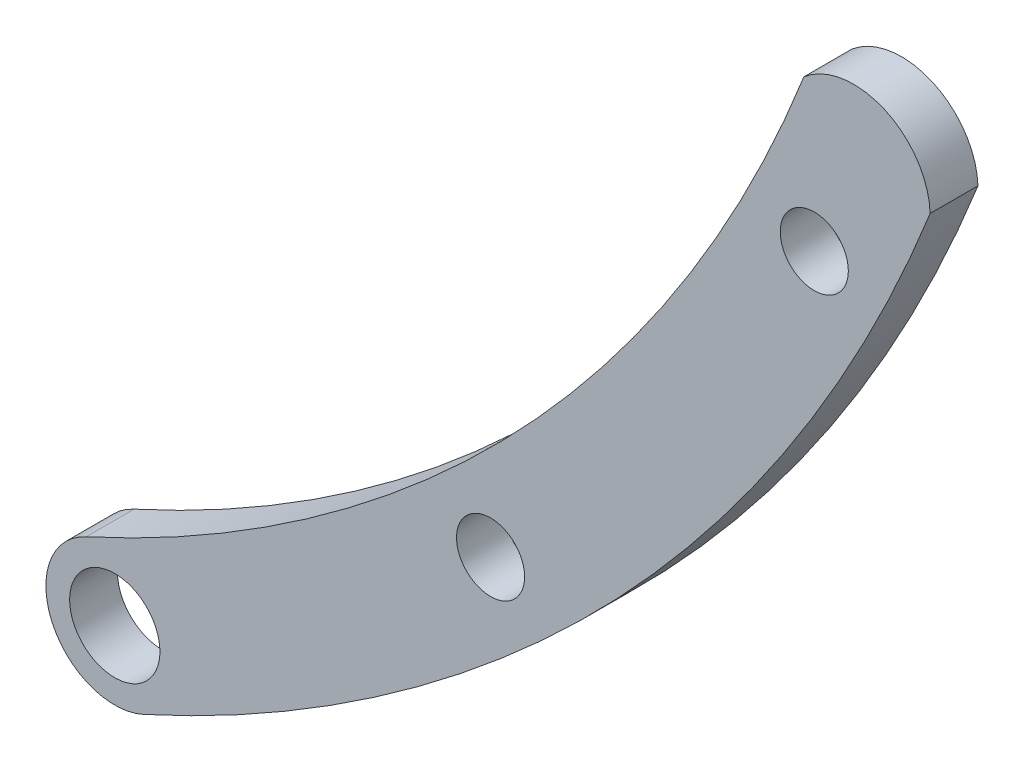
ISO-10303-21;
HEADER;
FILE_DESCRIPTION(('STEP AP214'),'2;1');
FILE_NAME('part.step','',(''),(''),'','','');
FILE_SCHEMA(('AUTOMOTIVE_DESIGN { 1 0 10303 214 1 1 1 1 }'));
ENDSEC;
DATA;
#1=APPLICATION_CONTEXT('core data for automotive mechanical design processes');
#2=APPLICATION_PROTOCOL_DEFINITION('international standard','automotive_design',2000,#1);
#3=PRODUCT_CONTEXT('',#1,'mechanical');
#4=PRODUCT('Part','Part','',(#3));
#5=PRODUCT_RELATED_PRODUCT_CATEGORY('part','',(#4));
#6=PRODUCT_DEFINITION_FORMATION('','',#4);
#7=PRODUCT_DEFINITION_CONTEXT('part definition',#1,'design');
#8=PRODUCT_DEFINITION('design','',#6,#7);
#9=PRODUCT_DEFINITION_SHAPE('','',#8);
#10=(LENGTH_UNIT() NAMED_UNIT(*) SI_UNIT(.MILLI.,.METRE.));
#11=(NAMED_UNIT(*) PLANE_ANGLE_UNIT() SI_UNIT($,.RADIAN.));
#12=(NAMED_UNIT(*) SI_UNIT($,.STERADIAN.) SOLID_ANGLE_UNIT());
#13=UNCERTAINTY_MEASURE_WITH_UNIT(LENGTH_MEASURE(1.E-05),#10,'distance_accuracy_value','');
#14=(GEOMETRIC_REPRESENTATION_CONTEXT(3) GLOBAL_UNCERTAINTY_ASSIGNED_CONTEXT((#13)) GLOBAL_UNIT_ASSIGNED_CONTEXT((#10,
#11,#12)) REPRESENTATION_CONTEXT('',''));
#15=CARTESIAN_POINT('',(0.,0.,0.));
#16=DIRECTION('',(0.,0.,1.));
#17=DIRECTION('',(1.,0.,0.));
#18=AXIS2_PLACEMENT_3D('',#15,#16,#17);
#19=CARTESIAN_POINT('',(-23.9673933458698,3.05846681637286,1.58750000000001));
#20=DIRECTION('',(0.,0.,-0.999999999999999));
#21=DIRECTION('',(-0.999999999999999,0.,0.));
#22=AXIS2_PLACEMENT_3D('',#19,#20,#21);
#23=PLANE('',#22);
#24=CARTESIAN_POINT('',(-1.4943540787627,-10.7338263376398,1.58750000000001));
#25=DIRECTION('',(0.,0.,0.999999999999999));
#26=DIRECTION('',(0.999999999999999,0.,0.));
#27=AXIS2_PLACEMENT_3D('',#24,#25,#26);
#28=CIRCLE('',#27,1.1303);
#29=CARTESIAN_POINT('',(-0.364054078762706,-10.7338263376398,1.58750000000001));
#30=VERTEX_POINT('',#29);
#31=EDGE_CURVE('E107',#30,#30,#28,.T.);
#32=ORIENTED_EDGE('',*,*,#31,.F.);
#33=EDGE_LOOP('',(#32));
#34=FACE_BOUND('',#33,.T.);
#35=CARTESIAN_POINT('',(9.25172308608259,3.43327413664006,1.5875));
#36=DIRECTION('',(0.,0.,0.999999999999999));
#37=DIRECTION('',(0.999999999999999,0.,0.));
#38=AXIS2_PLACEMENT_3D('',#35,#36,#37);
#39=CIRCLE('',#38,1.1303);
#40=CARTESIAN_POINT('',(10.3820230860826,3.43327413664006,1.5875));
#41=VERTEX_POINT('',#40);
#42=EDGE_CURVE('E98',#41,#41,#39,.T.);
#43=ORIENTED_EDGE('',*,*,#42,.F.);
#44=EDGE_LOOP('',(#43));
#45=FACE_BOUND('',#44,.T.);
#46=CARTESIAN_POINT('',(-33.9647866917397,25.0548821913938,1.5875));
#47=DIRECTION('',(0.,0.,0.999999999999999));
#48=DIRECTION('',(-0.999999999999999,0.,0.));
#49=AXIS2_PLACEMENT_3D('',#46,#47,#48);
#50=CIRCLE('',#49,50.6095);
#51=CARTESIAN_POINT('',(-13.0241230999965,-21.0190811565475,1.5875));
#52=VERTEX_POINT('',#51);
#53=CARTESIAN_POINT('',(13.0991355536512,6.44551054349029,1.58750000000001));
#54=VERTEX_POINT('',#53);
#55=EDGE_CURVE('E84',#52,#54,#50,.T.);
#56=ORIENTED_EDGE('',*,*,#55,.T.);
#57=CARTESIAN_POINT('',(10.5609319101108,6.34999999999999,1.58749999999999));
#58=DIRECTION('',(0.,0.,0.999999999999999));
#59=DIRECTION('',(0.999999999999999,0.,0.));
#60=AXIS2_PLACEMENT_3D('',#57,#58,#59);
#61=CIRCLE('',#60,2.54);
#62=CARTESIAN_POINT('',(8.90679250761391,8.27754321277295,1.5875));
#63=VERTEX_POINT('',#62);
#64=EDGE_CURVE('E49',#54,#63,#61,.T.);
#65=ORIENTED_EDGE('',*,*,#64,.T.);
#66=CARTESIAN_POINT('',(-33.9647866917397,25.0548821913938,1.5875));
#67=DIRECTION('',(0.,0.,-0.999999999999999));
#68=DIRECTION('',(-0.999999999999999,0.,0.));
#69=AXIS2_PLACEMENT_3D('',#66,#67,#68);
#70=CIRCLE('',#69,46.0375);
#71=CARTESIAN_POINT('',(-14.9158769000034,-16.8568159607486,1.5875));
#72=VERTEX_POINT('',#71);
#73=EDGE_CURVE('E91',#63,#72,#70,.T.);
#74=ORIENTED_EDGE('',*,*,#73,.T.);
#75=CARTESIAN_POINT('',(-13.97,-18.937948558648,1.5875));
#76=DIRECTION('',(0.,0.,0.999999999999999));
#77=DIRECTION('',(0.999999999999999,0.,0.));
#78=AXIS2_PLACEMENT_3D('',#75,#76,#77);
#79=CIRCLE('',#78,2.286);
#80=EDGE_CURVE('E58',#72,#52,#79,.T.);
#81=ORIENTED_EDGE('',*,*,#80,.T.);
#82=EDGE_LOOP('',(#56,#65,#74,#81));
#83=FACE_BOUND('',#82,.T.);
#84=CARTESIAN_POINT('',(-13.97,-18.937948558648,1.5875));
#85=DIRECTION('',(0.,0.,0.999999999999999));
#86=DIRECTION('',(0.999999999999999,0.,0.));
#87=AXIS2_PLACEMENT_3D('',#84,#85,#86);
#88=CIRCLE('',#87,1.4986);
#89=CARTESIAN_POINT('',(-15.4686,-18.937948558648,1.5875));
#90=VERTEX_POINT('',#89);
#91=EDGE_CURVE('E116',#90,#90,#88,.T.);
#92=ORIENTED_EDGE('',*,*,#91,.F.);
#93=EDGE_LOOP('',(#92));
#94=FACE_BOUND('',#93,.T.);
#95=ADVANCED_FACE('F32',(#34,#45,#83,#94),#23,.F.);
#96=CARTESIAN_POINT('',(-23.9673933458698,3.05846681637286,0.));
#97=DIRECTION('',(0.,0.,-0.999999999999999));
#98=DIRECTION('',(-0.999999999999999,0.,0.));
#99=AXIS2_PLACEMENT_3D('',#96,#97,#98);
#100=PLANE('',#99);
#101=CARTESIAN_POINT('',(-1.49435407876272,-10.7338263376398,0.));
#102=DIRECTION('',(0.,0.,-0.999999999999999));
#103=DIRECTION('',(-0.999999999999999,0.,0.));
#104=AXIS2_PLACEMENT_3D('',#101,#102,#103);
#105=CIRCLE('',#104,1.1303);
#106=CARTESIAN_POINT('',(-0.364054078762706,-10.7338263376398,0.));
#107=VERTEX_POINT('',#106);
#108=EDGE_CURVE('E36',#107,#107,#105,.T.);
#109=ORIENTED_EDGE('',*,*,#108,.F.);
#110=EDGE_LOOP('',(#109));
#111=FACE_BOUND('',#110,.T.);
#112=CARTESIAN_POINT('',(9.25172308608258,3.43327413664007,0.));
#113=DIRECTION('',(0.,0.,-0.999999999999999));
#114=DIRECTION('',(-0.999999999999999,0.,0.));
#115=AXIS2_PLACEMENT_3D('',#112,#113,#114);
#116=CIRCLE('',#115,1.1303);
#117=CARTESIAN_POINT('',(10.3820230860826,3.43327413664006,0.));
#118=VERTEX_POINT('',#117);
#119=EDGE_CURVE('E95',#118,#118,#116,.T.);
#120=ORIENTED_EDGE('',*,*,#119,.F.);
#121=EDGE_LOOP('',(#120));
#122=FACE_BOUND('',#121,.T.);
#123=CARTESIAN_POINT('',(10.5609319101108,6.34999999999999,0.));
#124=DIRECTION('',(0.,0.,-0.999999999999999));
#125=DIRECTION('',(-0.999999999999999,0.,0.));
#126=AXIS2_PLACEMENT_3D('',#123,#124,#125);
#127=CIRCLE('',#126,2.54);
#128=CARTESIAN_POINT('',(13.0991355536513,6.44551054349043,0.));
#129=VERTEX_POINT('',#128);
#130=CARTESIAN_POINT('',(8.90679250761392,8.27754321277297,0.));
#131=VERTEX_POINT('',#130);
#132=EDGE_CURVE('E90',#129,#131,#127,.F.);
#133=ORIENTED_EDGE('',*,*,#132,.F.);
#134=CARTESIAN_POINT('',(-33.9647866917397,25.0548821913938,0.));
#135=DIRECTION('',(0.,0.,0.999999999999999));
#136=DIRECTION('',(-0.999999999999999,0.,0.));
#137=AXIS2_PLACEMENT_3D('',#134,#135,#136);
#138=CIRCLE('',#137,50.6095);
#139=CARTESIAN_POINT('',(-13.0241230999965,-21.0190811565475,0.));
#140=VERTEX_POINT('',#139);
#141=EDGE_CURVE('E78',#140,#129,#138,.T.);
#142=ORIENTED_EDGE('',*,*,#141,.F.);
#143=CARTESIAN_POINT('',(-13.97,-18.937948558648,0.));
#144=DIRECTION('',(0.,0.,0.999999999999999));
#145=DIRECTION('',(0.999999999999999,0.,0.));
#146=AXIS2_PLACEMENT_3D('',#143,#144,#145);
#147=CIRCLE('',#146,2.286);
#148=CARTESIAN_POINT('',(-14.9158769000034,-16.8568159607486,0.));
#149=VERTEX_POINT('',#148);
#150=EDGE_CURVE('E70',#149,#140,#147,.T.);
#151=ORIENTED_EDGE('',*,*,#150,.F.);
#152=CARTESIAN_POINT('',(-33.9647866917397,25.0548821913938,0.));
#153=DIRECTION('',(0.,0.,-0.999999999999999));
#154=DIRECTION('',(-0.999999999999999,0.,0.));
#155=AXIS2_PLACEMENT_3D('',#152,#153,#154);
#156=CIRCLE('',#155,46.0375);
#157=EDGE_CURVE('E79',#131,#149,#156,.T.);
#158=ORIENTED_EDGE('',*,*,#157,.F.);
#159=EDGE_LOOP('',(#133,#142,#151,#158));
#160=FACE_BOUND('',#159,.T.);
#161=CARTESIAN_POINT('',(-13.97,-18.937948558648,0.));
#162=DIRECTION('',(0.,0.,0.999999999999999));
#163=DIRECTION('',(0.999999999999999,0.,0.));
#164=AXIS2_PLACEMENT_3D('',#161,#162,#163);
#165=CIRCLE('',#164,1.4986);
#166=CARTESIAN_POINT('',(-15.4686,-18.937948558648,0.));
#167=VERTEX_POINT('',#166);
#168=EDGE_CURVE('E115',#167,#167,#165,.T.);
#169=ORIENTED_EDGE('',*,*,#168,.T.);
#170=EDGE_LOOP('',(#169));
#171=FACE_BOUND('',#170,.T.);
#172=ADVANCED_FACE('F87',(#111,#122,#160,#171),#100,.T.);
#173=CARTESIAN_POINT('',(-33.9647866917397,25.0548821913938,1.5875));
#174=DIRECTION('',(0.,0.,-0.999999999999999));
#175=DIRECTION('',(-0.999999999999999,0.,0.));
#176=AXIS2_PLACEMENT_3D('',#173,#174,#175);
#177=CYLINDRICAL_SURFACE('',#176,46.0375);
#178=ORIENTED_EDGE('',*,*,#73,.F.);
#179=DIRECTION('',(0.,0.,-0.999999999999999));
#180=VECTOR('',#179,1.);
#181=CARTESIAN_POINT('',(8.90679250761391,8.27754321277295,1.5875));
#182=LINE('',#181,#180);
#183=EDGE_CURVE('E111',#63,#131,#182,.T.);
#184=ORIENTED_EDGE('',*,*,#183,.T.);
#185=ORIENTED_EDGE('',*,*,#157,.T.);
#186=DIRECTION('',(0.,0.,-0.999999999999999));
#187=VECTOR('',#186,1.);
#188=CARTESIAN_POINT('',(-14.9158769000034,-16.8568159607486,1.5875));
#189=LINE('',#188,#187);
#190=EDGE_CURVE('E11',#72,#149,#189,.T.);
#191=ORIENTED_EDGE('',*,*,#190,.F.);
#192=EDGE_LOOP('',(#178,#184,#185,#191));
#193=FACE_BOUND('',#192,.T.);
#194=ADVANCED_FACE('F34',(#193),#177,.F.);
#195=CARTESIAN_POINT('',(-13.97,-18.937948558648,1.5875));
#196=DIRECTION('',(0.,0.,-0.999999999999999));
#197=DIRECTION('',(-0.999999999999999,0.,0.));
#198=AXIS2_PLACEMENT_3D('',#195,#196,#197);
#199=CYLINDRICAL_SURFACE('',#198,2.286);
#200=ORIENTED_EDGE('',*,*,#150,.T.);
#201=DIRECTION('',(0.,0.,-0.999999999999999));
#202=VECTOR('',#201,1.);
#203=CARTESIAN_POINT('',(-13.0241230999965,-21.0190811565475,1.5875));
#204=LINE('',#203,#202);
#205=EDGE_CURVE('E41',#52,#140,#204,.T.);
#206=ORIENTED_EDGE('',*,*,#205,.F.);
#207=ORIENTED_EDGE('',*,*,#80,.F.);
#208=ORIENTED_EDGE('',*,*,#190,.T.);
#209=EDGE_LOOP('',(#200,#206,#207,#208));
#210=FACE_BOUND('',#209,.T.);
#211=ADVANCED_FACE('F72',(#210),#199,.T.);
#212=CARTESIAN_POINT('',(-33.9647866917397,25.0548821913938,1.5875));
#213=DIRECTION('',(0.,0.,-0.999999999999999));
#214=DIRECTION('',(-0.999999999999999,0.,0.));
#215=AXIS2_PLACEMENT_3D('',#212,#213,#214);
#216=CYLINDRICAL_SURFACE('',#215,50.6095);
#217=ORIENTED_EDGE('',*,*,#141,.T.);
#218=DIRECTION('',(0.,0.,-0.999999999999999));
#219=VECTOR('',#218,1.);
#220=CARTESIAN_POINT('',(13.0991355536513,6.44551054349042,1.58750000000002));
#221=LINE('',#220,#219);
#222=EDGE_CURVE('E97',#54,#129,#221,.T.);
#223=ORIENTED_EDGE('',*,*,#222,.F.);
#224=ORIENTED_EDGE('',*,*,#55,.F.);
#225=ORIENTED_EDGE('',*,*,#205,.T.);
#226=EDGE_LOOP('',(#217,#223,#224,#225));
#227=FACE_BOUND('',#226,.T.);
#228=ADVANCED_FACE('F83',(#227),#216,.T.);
#229=CARTESIAN_POINT('',(-13.97,-18.937948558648,1.5875));
#230=DIRECTION('',(0.,0.,-0.999999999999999));
#231=DIRECTION('',(-0.999999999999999,0.,0.));
#232=AXIS2_PLACEMENT_3D('',#229,#230,#231);
#233=CYLINDRICAL_SURFACE('',#232,1.4986);
#234=CARTESIAN_POINT('',(-15.4686,-18.937948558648,1.5875));
#235=CARTESIAN_POINT('',(-15.4686,-18.937948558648,1.57096354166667));
#236=CARTESIAN_POINT('',(-15.4686,-18.937948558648,1.55442708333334));
#237=CARTESIAN_POINT('',(-15.4686,-18.937948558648,1.52135416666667));
#238=CARTESIAN_POINT('',(-15.4686,-18.937948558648,1.50481770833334));
#239=CARTESIAN_POINT('',(-15.4686,-18.937948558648,1.47174479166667));
#240=CARTESIAN_POINT('',(-15.4686,-18.937948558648,1.45520833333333));
#241=CARTESIAN_POINT('',(-15.4686,-18.937948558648,1.42213541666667));
#242=CARTESIAN_POINT('',(-15.4686,-18.937948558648,1.40559895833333));
#243=CARTESIAN_POINT('',(-15.4686,-18.937948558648,1.37252604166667));
#244=CARTESIAN_POINT('',(-15.4686,-18.937948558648,1.35598958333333));
#245=CARTESIAN_POINT('',(-15.4686,-18.937948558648,1.32291666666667));
#246=CARTESIAN_POINT('',(-15.4686,-18.937948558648,1.30638020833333));
#247=CARTESIAN_POINT('',(-15.4686,-18.937948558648,1.27330729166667));
#248=CARTESIAN_POINT('',(-15.4686,-18.937948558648,1.25677083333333));
#249=CARTESIAN_POINT('',(-15.4686,-18.937948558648,1.22369791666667));
#250=CARTESIAN_POINT('',(-15.4686,-18.937948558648,1.20716145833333));
#251=CARTESIAN_POINT('',(-15.4686,-18.937948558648,1.17408854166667));
#252=CARTESIAN_POINT('',(-15.4686,-18.937948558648,1.15755208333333));
#253=CARTESIAN_POINT('',(-15.4686,-18.937948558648,1.12447916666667));
#254=CARTESIAN_POINT('',(-15.4686,-18.937948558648,1.10794270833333));
#255=CARTESIAN_POINT('',(-15.4686,-18.937948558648,1.07486979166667));
#256=CARTESIAN_POINT('',(-15.4686,-18.937948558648,1.05833333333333));
#257=CARTESIAN_POINT('',(-15.4686,-18.937948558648,1.02526041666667));
#258=CARTESIAN_POINT('',(-15.4686,-18.937948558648,1.00872395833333));
#259=CARTESIAN_POINT('',(-15.4686,-18.937948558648,0.975651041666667));
#260=CARTESIAN_POINT('',(-15.4686,-18.937948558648,0.959114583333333));
#261=CARTESIAN_POINT('',(-15.4686,-18.937948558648,0.926041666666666));
#262=CARTESIAN_POINT('',(-15.4686,-18.937948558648,0.909505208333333));
#263=CARTESIAN_POINT('',(-15.4686,-18.937948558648,0.876432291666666));
#264=CARTESIAN_POINT('',(-15.4686,-18.937948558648,0.859895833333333));
#265=CARTESIAN_POINT('',(-15.4686,-18.937948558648,0.826822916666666));
#266=CARTESIAN_POINT('',(-15.4686,-18.937948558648,0.810286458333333));
#267=CARTESIAN_POINT('',(-15.4686,-18.937948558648,0.777213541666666));
#268=CARTESIAN_POINT('',(-15.4686,-18.937948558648,0.760677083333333));
#269=CARTESIAN_POINT('',(-15.4686,-18.937948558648,0.727604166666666));
#270=CARTESIAN_POINT('',(-15.4686,-18.937948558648,0.711067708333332));
#271=CARTESIAN_POINT('',(-15.4686,-18.937948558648,0.677994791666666));
#272=CARTESIAN_POINT('',(-15.4686,-18.937948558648,0.661458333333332));
#273=CARTESIAN_POINT('',(-15.4686,-18.937948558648,0.628385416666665));
#274=CARTESIAN_POINT('',(-15.4686,-18.937948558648,0.611848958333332));
#275=CARTESIAN_POINT('',(-15.4686,-18.937948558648,0.578776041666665));
#276=CARTESIAN_POINT('',(-15.4686,-18.937948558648,0.562239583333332));
#277=CARTESIAN_POINT('',(-15.4686,-18.937948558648,0.529166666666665));
#278=CARTESIAN_POINT('',(-15.4686,-18.937948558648,0.512630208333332));
#279=CARTESIAN_POINT('',(-15.4686,-18.937948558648,0.479557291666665));
#280=CARTESIAN_POINT('',(-15.4686,-18.937948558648,0.463020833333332));
#281=CARTESIAN_POINT('',(-15.4686,-18.937948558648,0.429947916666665));
#282=CARTESIAN_POINT('',(-15.4686,-18.937948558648,0.413411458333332));
#283=CARTESIAN_POINT('',(-15.4686,-18.937948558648,0.380338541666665));
#284=CARTESIAN_POINT('',(-15.4686,-18.937948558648,0.363802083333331));
#285=CARTESIAN_POINT('',(-15.4686,-18.937948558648,0.330729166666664));
#286=CARTESIAN_POINT('',(-15.4686,-18.937948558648,0.314192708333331));
#287=CARTESIAN_POINT('',(-15.4686,-18.937948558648,0.281119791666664));
#288=CARTESIAN_POINT('',(-15.4686,-18.937948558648,0.264583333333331));
#289=CARTESIAN_POINT('',(-15.4686,-18.937948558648,0.231510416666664));
#290=CARTESIAN_POINT('',(-15.4686,-18.937948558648,0.214973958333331));
#291=CARTESIAN_POINT('',(-15.4686,-18.937948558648,0.181901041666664));
#292=CARTESIAN_POINT('',(-15.4686,-18.937948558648,0.16536458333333));
#293=CARTESIAN_POINT('',(-15.4686,-18.937948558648,0.132291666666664));
#294=CARTESIAN_POINT('',(-15.4686,-18.937948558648,0.11575520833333));
#295=CARTESIAN_POINT('',(-15.4686,-18.937948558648,0.0826822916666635));
#296=CARTESIAN_POINT('',(-15.4686,-18.937948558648,0.0661458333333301));
#297=CARTESIAN_POINT('',(-15.4686,-18.937948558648,0.0330729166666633));
#298=CARTESIAN_POINT('',(-15.4686,-18.937948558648,0.0165364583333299));
#299=CARTESIAN_POINT('',(-15.4686,-18.937948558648,0.));
#300=B_SPLINE_CURVE_WITH_KNOTS('',3,(#234,#235,#236,#237,#238,#239,#240,#241,#242,#243,#244,
#245,#246,#247,#248,#249,#250,#251,#252,#253,#254,#255,#256,#257,#258,#259,#260,#261,#262,#263,
#264,#265,#266,#267,#268,#269,#270,#271,#272,#273,#274,#275,#276,#277,#278,#279,#280,#281,#282,
#283,#284,#285,#286,#287,#288,#289,#290,#291,#292,#293,#294,#295,#296,#297,#298,#299),
.UNSPECIFIED.,.F.,.F.,(4,2,2,2,2,2,2,2,2,2,2,2,2,2,2,2,2,2,2,2,2,2,2,2,2,2,2,2,2,2,2,2,4),(0.,
0.0496093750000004,0.0992187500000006,0.148828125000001,0.198437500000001,0.248046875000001,
0.297656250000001,0.347265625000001,0.396875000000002,0.446484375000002,0.496093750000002,
0.545703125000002,0.595312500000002,0.644921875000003,0.694531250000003,0.744140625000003,
0.793750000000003,0.843359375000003,0.892968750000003,0.942578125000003,0.992187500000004,
1.041796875,1.09140625,1.141015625,1.190625,1.240234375,1.28984375,1.33945312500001,
1.38906250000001,1.43867187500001,1.48828125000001,1.53789062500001,1.58750000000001),.UNSPECIFIED.);
#301=EDGE_CURVE('BSEAM135',#90,#167,#300,.T.);
#302=ORIENTED_EDGE('',*,*,#91,.T.);
#303=ORIENTED_EDGE('',*,*,#168,.F.);
#304=ORIENTED_EDGE('',*,*,#301,.T.);
#305=ORIENTED_EDGE('',*,*,#301,.F.);
#306=EDGE_LOOP('',(#302,#304,#303,#305));
#307=FACE_BOUND('',#306,.T.);
#308=ADVANCED_FACE('F135',(#307),#233,.F.);
#309=CARTESIAN_POINT('',(10.5609319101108,6.34999999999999,1.58749999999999));
#310=DIRECTION('',(0.,0.,-0.999999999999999));
#311=DIRECTION('',(-0.999999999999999,0.,0.));
#312=AXIS2_PLACEMENT_3D('',#309,#310,#311);
#313=CYLINDRICAL_SURFACE('',#312,2.54);
#314=ORIENTED_EDGE('',*,*,#222,.T.);
#315=ORIENTED_EDGE('',*,*,#132,.T.);
#316=ORIENTED_EDGE('',*,*,#183,.F.);
#317=ORIENTED_EDGE('',*,*,#64,.F.);
#318=EDGE_LOOP('',(#314,#315,#316,#317));
#319=FACE_BOUND('',#318,.T.);
#320=ADVANCED_FACE('F128',(#319),#313,.T.);
#321=CARTESIAN_POINT('',(9.25172308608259,3.43327413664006,1.5875));
#322=DIRECTION('',(0.,0.,0.999999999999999));
#323=DIRECTION('',(0.999999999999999,0.,0.));
#324=AXIS2_PLACEMENT_3D('',#321,#322,#323);
#325=CYLINDRICAL_SURFACE('',#324,1.1303);
#326=CARTESIAN_POINT('',(10.3820230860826,3.43327413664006,0.));
#327=CARTESIAN_POINT('',(10.3820230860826,3.43327413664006,0.0165364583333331));
#328=CARTESIAN_POINT('',(10.3820230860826,3.43327413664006,0.0330729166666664));
#329=CARTESIAN_POINT('',(10.3820230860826,3.43327413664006,0.0661458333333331));
#330=CARTESIAN_POINT('',(10.3820230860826,3.43327413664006,0.0826822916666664));
#331=CARTESIAN_POINT('',(10.3820230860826,3.43327413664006,0.115755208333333));
#332=CARTESIAN_POINT('',(10.3820230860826,3.43327413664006,0.132291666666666));
#333=CARTESIAN_POINT('',(10.3820230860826,3.43327413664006,0.165364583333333));
#334=CARTESIAN_POINT('',(10.3820230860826,3.43327413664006,0.181901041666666));
#335=CARTESIAN_POINT('',(10.3820230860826,3.43327413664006,0.214973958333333));
#336=CARTESIAN_POINT('',(10.3820230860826,3.43327413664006,0.231510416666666));
#337=CARTESIAN_POINT('',(10.3820230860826,3.43327413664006,0.264583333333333));
#338=CARTESIAN_POINT('',(10.3820230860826,3.43327413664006,0.281119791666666));
#339=CARTESIAN_POINT('',(10.3820230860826,3.43327413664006,0.314192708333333));
#340=CARTESIAN_POINT('',(10.3820230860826,3.43327413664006,0.330729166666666));
#341=CARTESIAN_POINT('',(10.3820230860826,3.43327413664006,0.363802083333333));
#342=CARTESIAN_POINT('',(10.3820230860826,3.43327413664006,0.380338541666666));
#343=CARTESIAN_POINT('',(10.3820230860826,3.43327413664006,0.413411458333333));
#344=CARTESIAN_POINT('',(10.3820230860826,3.43327413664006,0.429947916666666));
#345=CARTESIAN_POINT('',(10.3820230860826,3.43327413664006,0.463020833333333));
#346=CARTESIAN_POINT('',(10.3820230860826,3.43327413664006,0.479557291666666));
#347=CARTESIAN_POINT('',(10.3820230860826,3.43327413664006,0.512630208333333));
#348=CARTESIAN_POINT('',(10.3820230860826,3.43327413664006,0.529166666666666));
#349=CARTESIAN_POINT('',(10.3820230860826,3.43327413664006,0.562239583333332));
#350=CARTESIAN_POINT('',(10.3820230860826,3.43327413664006,0.578776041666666));
#351=CARTESIAN_POINT('',(10.3820230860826,3.43327413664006,0.611848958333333));
#352=CARTESIAN_POINT('',(10.3820230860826,3.43327413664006,0.628385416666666));
#353=CARTESIAN_POINT('',(10.3820230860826,3.43327413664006,0.661458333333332));
#354=CARTESIAN_POINT('',(10.3820230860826,3.43327413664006,0.677994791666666));
#355=CARTESIAN_POINT('',(10.3820230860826,3.43327413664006,0.711067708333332));
#356=CARTESIAN_POINT('',(10.3820230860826,3.43327413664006,0.727604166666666));
#357=CARTESIAN_POINT('',(10.3820230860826,3.43327413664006,0.760677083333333));
#358=CARTESIAN_POINT('',(10.3820230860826,3.43327413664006,0.777213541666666));
#359=CARTESIAN_POINT('',(10.3820230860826,3.43327413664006,0.810286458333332));
#360=CARTESIAN_POINT('',(10.3820230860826,3.43327413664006,0.826822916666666));
#361=CARTESIAN_POINT('',(10.3820230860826,3.43327413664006,0.859895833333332));
#362=CARTESIAN_POINT('',(10.3820230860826,3.43327413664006,0.876432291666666));
#363=CARTESIAN_POINT('',(10.3820230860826,3.43327413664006,0.909505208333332));
#364=CARTESIAN_POINT('',(10.3820230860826,3.43327413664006,0.926041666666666));
#365=CARTESIAN_POINT('',(10.3820230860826,3.43327413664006,0.959114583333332));
#366=CARTESIAN_POINT('',(10.3820230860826,3.43327413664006,0.975651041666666));
#367=CARTESIAN_POINT('',(10.3820230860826,3.43327413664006,1.00872395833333));
#368=CARTESIAN_POINT('',(10.3820230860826,3.43327413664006,1.02526041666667));
#369=CARTESIAN_POINT('',(10.3820230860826,3.43327413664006,1.05833333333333));
#370=CARTESIAN_POINT('',(10.3820230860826,3.43327413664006,1.07486979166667));
#371=CARTESIAN_POINT('',(10.3820230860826,3.43327413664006,1.10794270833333));
#372=CARTESIAN_POINT('',(10.3820230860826,3.43327413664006,1.12447916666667));
#373=CARTESIAN_POINT('',(10.3820230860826,3.43327413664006,1.15755208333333));
#374=CARTESIAN_POINT('',(10.3820230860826,3.43327413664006,1.17408854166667));
#375=CARTESIAN_POINT('',(10.3820230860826,3.43327413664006,1.20716145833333));
#376=CARTESIAN_POINT('',(10.3820230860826,3.43327413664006,1.22369791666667));
#377=CARTESIAN_POINT('',(10.3820230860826,3.43327413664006,1.25677083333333));
#378=CARTESIAN_POINT('',(10.3820230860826,3.43327413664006,1.27330729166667));
#379=CARTESIAN_POINT('',(10.3820230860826,3.43327413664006,1.30638020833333));
#380=CARTESIAN_POINT('',(10.3820230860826,3.43327413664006,1.32291666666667));
#381=CARTESIAN_POINT('',(10.3820230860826,3.43327413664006,1.35598958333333));
#382=CARTESIAN_POINT('',(10.3820230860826,3.43327413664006,1.37252604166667));
#383=CARTESIAN_POINT('',(10.3820230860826,3.43327413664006,1.40559895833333));
#384=CARTESIAN_POINT('',(10.3820230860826,3.43327413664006,1.42213541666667));
#385=CARTESIAN_POINT('',(10.3820230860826,3.43327413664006,1.45520833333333));
#386=CARTESIAN_POINT('',(10.3820230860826,3.43327413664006,1.47174479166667));
#387=CARTESIAN_POINT('',(10.3820230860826,3.43327413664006,1.50481770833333));
#388=CARTESIAN_POINT('',(10.3820230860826,3.43327413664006,1.52135416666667));
#389=CARTESIAN_POINT('',(10.3820230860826,3.43327413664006,1.55442708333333));
#390=CARTESIAN_POINT('',(10.3820230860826,3.43327413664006,1.57096354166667));
#391=CARTESIAN_POINT('',(10.3820230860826,3.43327413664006,1.5875));
#392=B_SPLINE_CURVE_WITH_KNOTS('',3,(#326,#327,#328,#329,#330,#331,#332,#333,#334,#335,#336,
#337,#338,#339,#340,#341,#342,#343,#344,#345,#346,#347,#348,#349,#350,#351,#352,#353,#354,#355,
#356,#357,#358,#359,#360,#361,#362,#363,#364,#365,#366,#367,#368,#369,#370,#371,#372,#373,#374,
#375,#376,#377,#378,#379,#380,#381,#382,#383,#384,#385,#386,#387,#388,#389,#390,#391),
.UNSPECIFIED.,.F.,.F.,(4,2,2,2,2,2,2,2,2,2,2,2,2,2,2,2,2,2,2,2,2,2,2,2,2,2,2,2,2,2,2,2,4),(0.,
0.049609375,0.0992187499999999,0.148828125,0.1984375,0.248046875,0.29765625,0.347265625,
0.396875,0.446484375,0.49609375,0.545703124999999,0.595312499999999,0.644921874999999,
0.694531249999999,0.744140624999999,0.793749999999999,0.843359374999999,0.892968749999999,
0.942578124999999,0.992187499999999,1.041796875,1.09140625,1.141015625,1.190625,1.240234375,
1.28984375,1.339453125,1.3890625,1.438671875,1.48828125,1.537890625,1.5875),.UNSPECIFIED.);
#393=EDGE_CURVE('BSEAM169',#118,#41,#392,.T.);
#394=ORIENTED_EDGE('',*,*,#119,.T.);
#395=ORIENTED_EDGE('',*,*,#42,.T.);
#396=ORIENTED_EDGE('',*,*,#393,.T.);
#397=ORIENTED_EDGE('',*,*,#393,.F.);
#398=EDGE_LOOP('',(#394,#396,#395,#397));
#399=FACE_BOUND('',#398,.T.);
#400=ADVANCED_FACE('F169',(#399),#325,.F.);
#401=CARTESIAN_POINT('',(-1.4943540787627,-10.7338263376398,1.58750000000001));
#402=DIRECTION('',(0.,0.,0.999999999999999));
#403=DIRECTION('',(0.999999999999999,0.,0.));
#404=AXIS2_PLACEMENT_3D('',#401,#402,#403);
#405=CYLINDRICAL_SURFACE('',#404,1.1303);
#406=CARTESIAN_POINT('',(-0.364054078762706,-10.7338263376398,0.));
#407=CARTESIAN_POINT('',(-0.364054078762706,-10.7338263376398,0.0165364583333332));
#408=CARTESIAN_POINT('',(-0.364054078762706,-10.7338263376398,0.0330729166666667));
#409=CARTESIAN_POINT('',(-0.364054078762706,-10.7338263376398,0.0661458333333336));
#410=CARTESIAN_POINT('',(-0.364054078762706,-10.7338263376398,0.082682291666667));
#411=CARTESIAN_POINT('',(-0.364054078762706,-10.7338263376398,0.115755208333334));
#412=CARTESIAN_POINT('',(-0.364054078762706,-10.7338263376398,0.132291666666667));
#413=CARTESIAN_POINT('',(-0.364054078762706,-10.7338263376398,0.165364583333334));
#414=CARTESIAN_POINT('',(-0.364054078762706,-10.7338263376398,0.181901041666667));
#415=CARTESIAN_POINT('',(-0.364054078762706,-10.7338263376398,0.214973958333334));
#416=CARTESIAN_POINT('',(-0.364054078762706,-10.7338263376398,0.231510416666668));
#417=CARTESIAN_POINT('',(-0.364054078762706,-10.7338263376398,0.264583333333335));
#418=CARTESIAN_POINT('',(-0.364054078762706,-10.7338263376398,0.281119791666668));
#419=CARTESIAN_POINT('',(-0.364054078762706,-10.7338263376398,0.314192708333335));
#420=CARTESIAN_POINT('',(-0.364054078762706,-10.7338263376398,0.330729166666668));
#421=CARTESIAN_POINT('',(-0.364054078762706,-10.7338263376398,0.363802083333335));
#422=CARTESIAN_POINT('',(-0.364054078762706,-10.7338263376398,0.380338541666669));
#423=CARTESIAN_POINT('',(-0.364054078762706,-10.7338263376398,0.413411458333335));
#424=CARTESIAN_POINT('',(-0.364054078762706,-10.7338263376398,0.429947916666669));
#425=CARTESIAN_POINT('',(-0.364054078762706,-10.7338263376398,0.463020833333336));
#426=CARTESIAN_POINT('',(-0.364054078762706,-10.7338263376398,0.479557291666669));
#427=CARTESIAN_POINT('',(-0.364054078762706,-10.7338263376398,0.512630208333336));
#428=CARTESIAN_POINT('',(-0.364054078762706,-10.7338263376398,0.529166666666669));
#429=CARTESIAN_POINT('',(-0.364054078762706,-10.7338263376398,0.562239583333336));
#430=CARTESIAN_POINT('',(-0.364054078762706,-10.7338263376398,0.57877604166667));
#431=CARTESIAN_POINT('',(-0.364054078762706,-10.7338263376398,0.611848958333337));
#432=CARTESIAN_POINT('',(-0.364054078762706,-10.7338263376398,0.62838541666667));
#433=CARTESIAN_POINT('',(-0.364054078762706,-10.7338263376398,0.661458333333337));
#434=CARTESIAN_POINT('',(-0.364054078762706,-10.7338263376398,0.67799479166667));
#435=CARTESIAN_POINT('',(-0.364054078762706,-10.7338263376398,0.711067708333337));
#436=CARTESIAN_POINT('',(-0.364054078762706,-10.7338263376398,0.727604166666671));
#437=CARTESIAN_POINT('',(-0.364054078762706,-10.7338263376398,0.760677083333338));
#438=CARTESIAN_POINT('',(-0.364054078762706,-10.7338263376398,0.777213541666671));
#439=CARTESIAN_POINT('',(-0.364054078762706,-10.7338263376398,0.810286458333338));
#440=CARTESIAN_POINT('',(-0.364054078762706,-10.7338263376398,0.826822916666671));
#441=CARTESIAN_POINT('',(-0.364054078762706,-10.7338263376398,0.859895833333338));
#442=CARTESIAN_POINT('',(-0.364054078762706,-10.7338263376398,0.876432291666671));
#443=CARTESIAN_POINT('',(-0.364054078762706,-10.7338263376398,0.909505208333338));
#444=CARTESIAN_POINT('',(-0.364054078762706,-10.7338263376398,0.926041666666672));
#445=CARTESIAN_POINT('',(-0.364054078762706,-10.7338263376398,0.959114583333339));
#446=CARTESIAN_POINT('',(-0.364054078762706,-10.7338263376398,0.975651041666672));
#447=CARTESIAN_POINT('',(-0.364054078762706,-10.7338263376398,1.00872395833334));
#448=CARTESIAN_POINT('',(-0.364054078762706,-10.7338263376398,1.02526041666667));
#449=CARTESIAN_POINT('',(-0.364054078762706,-10.7338263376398,1.05833333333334));
#450=CARTESIAN_POINT('',(-0.364054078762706,-10.7338263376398,1.07486979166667));
#451=CARTESIAN_POINT('',(-0.364054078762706,-10.7338263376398,1.10794270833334));
#452=CARTESIAN_POINT('',(-0.364054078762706,-10.7338263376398,1.12447916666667));
#453=CARTESIAN_POINT('',(-0.364054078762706,-10.7338263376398,1.15755208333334));
#454=CARTESIAN_POINT('',(-0.364054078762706,-10.7338263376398,1.17408854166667));
#455=CARTESIAN_POINT('',(-0.364054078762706,-10.7338263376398,1.20716145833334));
#456=CARTESIAN_POINT('',(-0.364054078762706,-10.7338263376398,1.22369791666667));
#457=CARTESIAN_POINT('',(-0.364054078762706,-10.7338263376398,1.25677083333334));
#458=CARTESIAN_POINT('',(-0.364054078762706,-10.7338263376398,1.27330729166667));
#459=CARTESIAN_POINT('',(-0.364054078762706,-10.7338263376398,1.30638020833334));
#460=CARTESIAN_POINT('',(-0.364054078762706,-10.7338263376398,1.32291666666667));
#461=CARTESIAN_POINT('',(-0.364054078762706,-10.7338263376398,1.35598958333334));
#462=CARTESIAN_POINT('',(-0.364054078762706,-10.7338263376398,1.37252604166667));
#463=CARTESIAN_POINT('',(-0.364054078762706,-10.7338263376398,1.40559895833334));
#464=CARTESIAN_POINT('',(-0.364054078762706,-10.7338263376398,1.42213541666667));
#465=CARTESIAN_POINT('',(-0.364054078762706,-10.7338263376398,1.45520833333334));
#466=CARTESIAN_POINT('',(-0.364054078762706,-10.7338263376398,1.47174479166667));
#467=CARTESIAN_POINT('',(-0.364054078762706,-10.7338263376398,1.50481770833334));
#468=CARTESIAN_POINT('',(-0.364054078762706,-10.7338263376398,1.52135416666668));
#469=CARTESIAN_POINT('',(-0.364054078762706,-10.7338263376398,1.55442708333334));
#470=CARTESIAN_POINT('',(-0.364054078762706,-10.7338263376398,1.57096354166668));
#471=CARTESIAN_POINT('',(-0.364054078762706,-10.7338263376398,1.58750000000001));
#472=B_SPLINE_CURVE_WITH_KNOTS('',3,(#406,#407,#408,#409,#410,#411,#412,#413,#414,#415,#416,
#417,#418,#419,#420,#421,#422,#423,#424,#425,#426,#427,#428,#429,#430,#431,#432,#433,#434,#435,
#436,#437,#438,#439,#440,#441,#442,#443,#444,#445,#446,#447,#448,#449,#450,#451,#452,#453,#454,
#455,#456,#457,#458,#459,#460,#461,#462,#463,#464,#465,#466,#467,#468,#469,#470,#471),
.UNSPECIFIED.,.F.,.F.,(4,2,2,2,2,2,2,2,2,2,2,2,2,2,2,2,2,2,2,2,2,2,2,2,2,2,2,2,2,2,2,2,4),(0.,
0.0496093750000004,0.0992187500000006,0.148828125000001,0.198437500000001,0.248046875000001,
0.297656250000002,0.347265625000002,0.396875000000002,0.446484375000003,0.496093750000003,
0.545703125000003,0.595312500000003,0.644921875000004,0.694531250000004,0.744140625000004,
0.793750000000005,0.843359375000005,0.892968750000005,0.942578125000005,0.992187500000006,
1.04179687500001,1.09140625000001,1.14101562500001,1.19062500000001,1.24023437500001,
1.28984375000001,1.33945312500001,1.38906250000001,1.43867187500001,1.48828125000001,
1.53789062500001,1.58750000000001),.UNSPECIFIED.);
#473=EDGE_CURVE('BSEAM176',#107,#30,#472,.T.);
#474=ORIENTED_EDGE('',*,*,#108,.T.);
#475=ORIENTED_EDGE('',*,*,#31,.T.);
#476=ORIENTED_EDGE('',*,*,#473,.T.);
#477=ORIENTED_EDGE('',*,*,#473,.F.);
#478=EDGE_LOOP('',(#474,#476,#475,#477));
#479=FACE_BOUND('',#478,.T.);
#480=ADVANCED_FACE('F176',(#479),#405,.F.);
#481=CLOSED_SHELL('',(#95,#172,#194,#211,#228,#308,#320,#400,#480));
#482=MANIFOLD_SOLID_BREP('B2',#481);
#483=ADVANCED_BREP_SHAPE_REPRESENTATION('',(#18,#482),#14);
#484=SHAPE_DEFINITION_REPRESENTATION(#9,#483);
ENDSEC;
END-ISO-10303-21;
